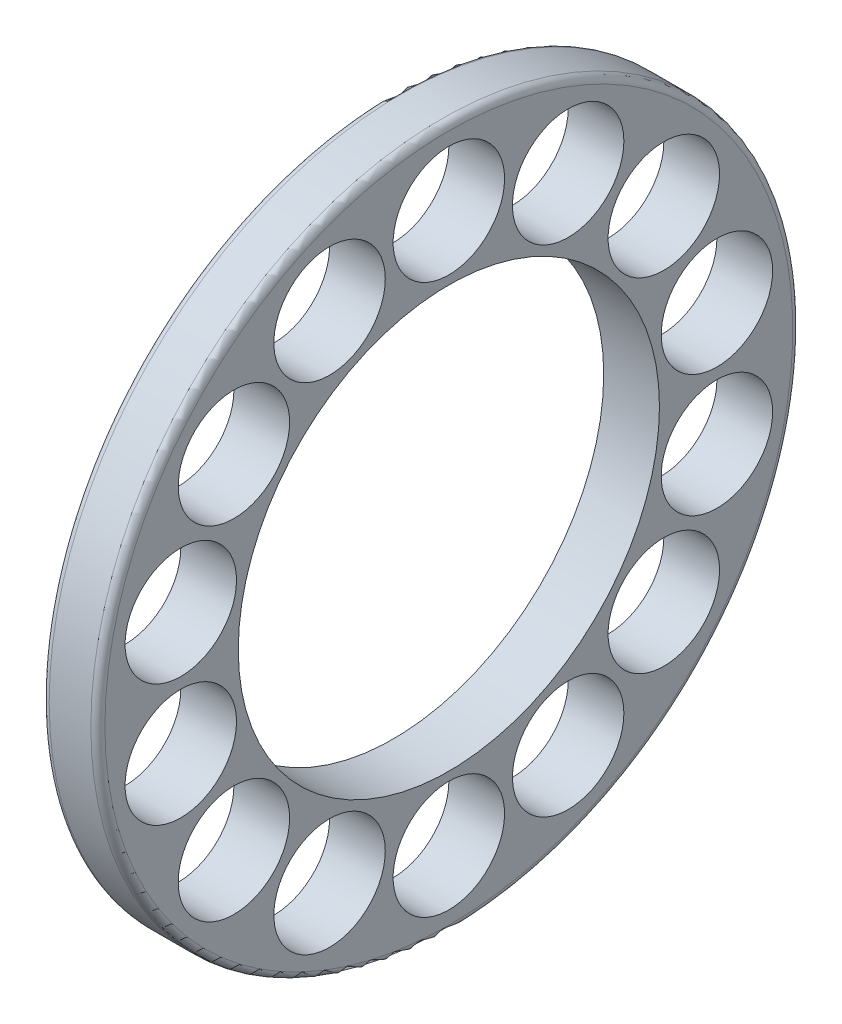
ISO-10303-21;
HEADER;
FILE_DESCRIPTION(('STEP AP214'),'2;1');
FILE_NAME('part.step','',(''),(''),'','','');
FILE_SCHEMA(('AUTOMOTIVE_DESIGN { 1 0 10303 214 1 1 1 1 }'));
ENDSEC;
DATA;
#1=APPLICATION_CONTEXT('core data for automotive mechanical design processes');
#2=APPLICATION_PROTOCOL_DEFINITION('international standard','automotive_design',2000,#1);
#3=PRODUCT_CONTEXT('',#1,'mechanical');
#4=PRODUCT('Part','Part','',(#3));
#5=PRODUCT_RELATED_PRODUCT_CATEGORY('part','',(#4));
#6=PRODUCT_DEFINITION_FORMATION('','',#4);
#7=PRODUCT_DEFINITION_CONTEXT('part definition',#1,'design');
#8=PRODUCT_DEFINITION('design','',#6,#7);
#9=PRODUCT_DEFINITION_SHAPE('','',#8);
#10=(LENGTH_UNIT() NAMED_UNIT(*) SI_UNIT(.MILLI.,.METRE.));
#11=(NAMED_UNIT(*) PLANE_ANGLE_UNIT() SI_UNIT($,.RADIAN.));
#12=(NAMED_UNIT(*) SI_UNIT($,.STERADIAN.) SOLID_ANGLE_UNIT());
#13=UNCERTAINTY_MEASURE_WITH_UNIT(LENGTH_MEASURE(1.E-05),#10,'distance_accuracy_value','');
#14=(GEOMETRIC_REPRESENTATION_CONTEXT(3) GLOBAL_UNCERTAINTY_ASSIGNED_CONTEXT((#13)) GLOBAL_UNIT_ASSIGNED_CONTEXT((#10,
#11,#12)) REPRESENTATION_CONTEXT('',''));
#15=CARTESIAN_POINT('',(0.,0.,0.));
#16=DIRECTION('',(0.,0.,1.));
#17=DIRECTION('',(1.,0.,0.));
#18=AXIS2_PLACEMENT_3D('',#15,#16,#17);
#19=CARTESIAN_POINT('',(3.3095,-14.9730722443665,-14.7));
#20=DIRECTION('',(-1.,0.,0.));
#21=DIRECTION('',(0.,0.,1.));
#22=AXIS2_PLACEMENT_3D('',#19,#20,#21);
#23=PLANE('',#22);
#24=CARTESIAN_POINT('',(3.3095,0.,0.));
#25=DIRECTION('',(-1.,0.,0.));
#26=DIRECTION('',(0.,0.,-1.));
#27=AXIS2_PLACEMENT_3D('',#24,#25,#26);
#28=CIRCLE('',#27,14.7000000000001);
#29=CARTESIAN_POINT('',(3.3095,0.,-14.7000000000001));
#30=VERTEX_POINT('',#29);
#31=EDGE_CURVE('E121',#30,#30,#28,.F.);
#32=ORIENTED_EDGE('',*,*,#31,.F.);
#33=EDGE_LOOP('',(#32));
#34=FACE_BOUND('',#33,.T.);
#35=CARTESIAN_POINT('',(3.3095,0.,0.));
#36=DIRECTION('',(1.,0.,0.));
#37=DIRECTION('',(0.,0.,1.));
#38=AXIS2_PLACEMENT_3D('',#35,#36,#37);
#39=CIRCLE('',#38,9.);
#40=CARTESIAN_POINT('',(3.3095,0.,9.));
#41=VERTEX_POINT('',#40);
#42=EDGE_CURVE('E118',#41,#41,#39,.T.);
#43=ORIENTED_EDGE('',*,*,#42,.T.);
#44=EDGE_LOOP('',(#43));
#45=FACE_BOUND('',#44,.T.);
#46=CARTESIAN_POINT('',(3.3095,-10.586384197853,-5.0981339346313));
#47=DIRECTION('',(1.,0.,0.));
#48=DIRECTION('',(0.,0.,1.));
#49=AXIS2_PLACEMENT_3D('',#46,#47,#48);
#50=CIRCLE('',#49,2.381);
#51=CARTESIAN_POINT('',(3.3095,-10.586384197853,-2.7171339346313));
#52=VERTEX_POINT('',#51);
#53=EDGE_CURVE('E115',#52,#52,#50,.T.);
#54=ORIENTED_EDGE('',*,*,#53,.T.);
#55=EDGE_LOOP('',(#54));
#56=FACE_BOUND('',#55,.T.);
#57=CARTESIAN_POINT('',(3.3095,-7.3260051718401,-9.1865199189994));
#58=DIRECTION('',(1.,0.,0.));
#59=DIRECTION('',(0.,0.,1.));
#60=AXIS2_PLACEMENT_3D('',#57,#58,#59);
#61=CIRCLE('',#60,2.381);
#62=CARTESIAN_POINT('',(3.3095,-7.3260051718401,-6.8055199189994));
#63=VERTEX_POINT('',#62);
#64=EDGE_CURVE('E112',#63,#63,#61,.T.);
#65=ORIENTED_EDGE('',*,*,#64,.T.);
#66=EDGE_LOOP('',(#65));
#67=FACE_BOUND('',#66,.T.);
#68=CARTESIAN_POINT('',(3.3095,-11.75,0.));
#69=DIRECTION('',(1.,0.,0.));
#70=DIRECTION('',(0.,0.,1.));
#71=AXIS2_PLACEMENT_3D('',#68,#69,#70);
#72=CIRCLE('',#71,2.381);
#73=CARTESIAN_POINT('',(3.3095,-11.75,2.381));
#74=VERTEX_POINT('',#73);
#75=EDGE_CURVE('E109',#74,#74,#72,.T.);
#76=ORIENTED_EDGE('',*,*,#75,.T.);
#77=EDGE_LOOP('',(#76));
#78=FACE_BOUND('',#77,.T.);
#79=CARTESIAN_POINT('',(3.3095,-10.586384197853,5.0981339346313));
#80=DIRECTION('',(1.,0.,0.));
#81=DIRECTION('',(0.,0.,1.));
#82=AXIS2_PLACEMENT_3D('',#79,#80,#81);
#83=CIRCLE('',#82,2.381);
#84=CARTESIAN_POINT('',(3.3095,-10.586384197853,7.4791339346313));
#85=VERTEX_POINT('',#84);
#86=EDGE_CURVE('E106',#85,#85,#83,.T.);
#87=ORIENTED_EDGE('',*,*,#86,.T.);
#88=EDGE_LOOP('',(#87));
#89=FACE_BOUND('',#88,.T.);
#90=CARTESIAN_POINT('',(3.3095,-2.6146209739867,11.455402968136));
#91=DIRECTION('',(1.,0.,0.));
#92=DIRECTION('',(0.,0.,1.));
#93=AXIS2_PLACEMENT_3D('',#90,#91,#92);
#94=CIRCLE('',#93,2.381);
#95=CARTESIAN_POINT('',(3.3095,-2.6146209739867,13.836402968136));
#96=VERTEX_POINT('',#95);
#97=EDGE_CURVE('E103',#96,#96,#94,.T.);
#98=ORIENTED_EDGE('',*,*,#97,.T.);
#99=EDGE_LOOP('',(#98));
#100=FACE_BOUND('',#99,.T.);
#101=CARTESIAN_POINT('',(3.3095,-7.3260051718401,9.1865199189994));
#102=DIRECTION('',(1.,0.,0.));
#103=DIRECTION('',(0.,0.,1.));
#104=AXIS2_PLACEMENT_3D('',#101,#102,#103);
#105=CIRCLE('',#104,2.381);
#106=CARTESIAN_POINT('',(3.3095,-7.3260051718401,11.5675199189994));
#107=VERTEX_POINT('',#106);
#108=EDGE_CURVE('E100',#107,#107,#105,.T.);
#109=ORIENTED_EDGE('',*,*,#108,.T.);
#110=EDGE_LOOP('',(#109));
#111=FACE_BOUND('',#110,.T.);
#112=CARTESIAN_POINT('',(3.3095,7.3260051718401,9.1865199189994));
#113=DIRECTION('',(1.,0.,0.));
#114=DIRECTION('',(0.,0.,1.));
#115=AXIS2_PLACEMENT_3D('',#112,#113,#114);
#116=CIRCLE('',#115,2.381);
#117=CARTESIAN_POINT('',(3.3095,7.32600517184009,11.5675199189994));
#118=VERTEX_POINT('',#117);
#119=EDGE_CURVE('E97',#118,#118,#116,.T.);
#120=ORIENTED_EDGE('',*,*,#119,.T.);
#121=EDGE_LOOP('',(#120));
#122=FACE_BOUND('',#121,.T.);
#123=CARTESIAN_POINT('',(3.3095,2.6146209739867,11.455402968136));
#124=DIRECTION('',(1.,0.,0.));
#125=DIRECTION('',(0.,0.,1.));
#126=AXIS2_PLACEMENT_3D('',#123,#124,#125);
#127=CIRCLE('',#126,2.381);
#128=CARTESIAN_POINT('',(3.3095,2.6146209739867,13.836402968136));
#129=VERTEX_POINT('',#128);
#130=EDGE_CURVE('E94',#129,#129,#127,.T.);
#131=ORIENTED_EDGE('',*,*,#130,.T.);
#132=EDGE_LOOP('',(#131));
#133=FACE_BOUND('',#132,.T.);
#134=CARTESIAN_POINT('',(3.3095,7.3260051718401,-9.1865199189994));
#135=DIRECTION('',(1.,0.,0.));
#136=DIRECTION('',(0.,0.,1.));
#137=AXIS2_PLACEMENT_3D('',#134,#135,#136);
#138=CIRCLE('',#137,2.381);
#139=CARTESIAN_POINT('',(3.3095,7.32600517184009,-6.8055199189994));
#140=VERTEX_POINT('',#139);
#141=EDGE_CURVE('E91',#140,#140,#138,.T.);
#142=ORIENTED_EDGE('',*,*,#141,.T.);
#143=EDGE_LOOP('',(#142));
#144=FACE_BOUND('',#143,.T.);
#145=CARTESIAN_POINT('',(3.3095,10.586384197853,-5.0981339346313));
#146=DIRECTION('',(1.,0.,0.));
#147=DIRECTION('',(0.,0.,1.));
#148=AXIS2_PLACEMENT_3D('',#145,#146,#147);
#149=CIRCLE('',#148,2.381);
#150=CARTESIAN_POINT('',(3.3095,10.586384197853,-2.7171339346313));
#151=VERTEX_POINT('',#150);
#152=EDGE_CURVE('E88',#151,#151,#149,.T.);
#153=ORIENTED_EDGE('',*,*,#152,.T.);
#154=EDGE_LOOP('',(#153));
#155=FACE_BOUND('',#154,.T.);
#156=CARTESIAN_POINT('',(3.3095,2.6146209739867,-11.455402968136));
#157=DIRECTION('',(1.,0.,0.));
#158=DIRECTION('',(0.,0.,1.));
#159=AXIS2_PLACEMENT_3D('',#156,#157,#158);
#160=CIRCLE('',#159,2.381);
#161=CARTESIAN_POINT('',(3.3095,2.6146209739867,-9.074402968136));
#162=VERTEX_POINT('',#161);
#163=EDGE_CURVE('E85',#162,#162,#160,.T.);
#164=ORIENTED_EDGE('',*,*,#163,.T.);
#165=EDGE_LOOP('',(#164));
#166=FACE_BOUND('',#165,.T.);
#167=CARTESIAN_POINT('',(3.3095,-2.6146209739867,-11.455402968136));
#168=DIRECTION('',(1.,0.,0.));
#169=DIRECTION('',(0.,0.,1.));
#170=AXIS2_PLACEMENT_3D('',#167,#168,#169);
#171=CIRCLE('',#170,2.381);
#172=CARTESIAN_POINT('',(3.3095,-2.6146209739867,-9.074402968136));
#173=VERTEX_POINT('',#172);
#174=EDGE_CURVE('E82',#173,#173,#171,.T.);
#175=ORIENTED_EDGE('',*,*,#174,.T.);
#176=EDGE_LOOP('',(#175));
#177=FACE_BOUND('',#176,.T.);
#178=CARTESIAN_POINT('',(3.3095,10.586384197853,5.0981339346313));
#179=DIRECTION('',(1.,0.,0.));
#180=DIRECTION('',(0.,0.,1.));
#181=AXIS2_PLACEMENT_3D('',#178,#179,#180);
#182=CIRCLE('',#181,2.381);
#183=CARTESIAN_POINT('',(3.3095,10.586384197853,7.4791339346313));
#184=VERTEX_POINT('',#183);
#185=EDGE_CURVE('E79',#184,#184,#182,.T.);
#186=ORIENTED_EDGE('',*,*,#185,.T.);
#187=EDGE_LOOP('',(#186));
#188=FACE_BOUND('',#187,.T.);
#189=CARTESIAN_POINT('',(3.3095,11.75,0.));
#190=DIRECTION('',(1.,0.,0.));
#191=DIRECTION('',(0.,0.,1.));
#192=AXIS2_PLACEMENT_3D('',#189,#190,#191);
#193=CIRCLE('',#192,2.381);
#194=CARTESIAN_POINT('',(3.3095,11.75,2.381));
#195=VERTEX_POINT('',#194);
#196=EDGE_CURVE('E76',#195,#195,#193,.T.);
#197=ORIENTED_EDGE('',*,*,#196,.T.);
#198=EDGE_LOOP('',(#197));
#199=FACE_BOUND('',#198,.T.);
#200=ADVANCED_FACE('F14',(#34,#45,#56,#67,#78,#89,#100,#111,#122,#133,#144,#155,#166,#177,#188,
#199),#23,.T.);
#201=CARTESIAN_POINT('',(5.6905,-14.9730722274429,14.7));
#202=DIRECTION('',(1.,0.,0.));
#203=DIRECTION('',(0.,0.,-1.));
#204=AXIS2_PLACEMENT_3D('',#201,#202,#203);
#205=PLANE('',#204);
#206=CARTESIAN_POINT('',(5.6905,0.,0.));
#207=DIRECTION('',(1.,0.,0.));
#208=DIRECTION('',(0.,-1.16855749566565E-09,1.));
#209=AXIS2_PLACEMENT_3D('',#206,#207,#208);
#210=CIRCLE('',#209,14.7);
#211=CARTESIAN_POINT('',(5.6905,-1.7177795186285E-08,14.7));
#212=VERTEX_POINT('',#211);
#213=EDGE_CURVE('E73',#212,#212,#210,.T.);
#214=ORIENTED_EDGE('',*,*,#213,.T.);
#215=EDGE_LOOP('',(#214));
#216=FACE_BOUND('',#215,.T.);
#217=CARTESIAN_POINT('',(5.6905,0.,0.));
#218=DIRECTION('',(-1.,0.,0.));
#219=DIRECTION('',(0.,0.,-1.));
#220=AXIS2_PLACEMENT_3D('',#217,#218,#219);
#221=CIRCLE('',#220,9.);
#222=CARTESIAN_POINT('',(5.6905,0.,-9.));
#223=VERTEX_POINT('',#222);
#224=EDGE_CURVE('E70',#223,#223,#221,.F.);
#225=ORIENTED_EDGE('',*,*,#224,.F.);
#226=EDGE_LOOP('',(#225));
#227=FACE_BOUND('',#226,.T.);
#228=CARTESIAN_POINT('',(5.6905,-10.586384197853,-5.0981339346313));
#229=DIRECTION('',(-1.,0.,0.));
#230=DIRECTION('',(0.,0.,-1.));
#231=AXIS2_PLACEMENT_3D('',#228,#229,#230);
#232=CIRCLE('',#231,2.381);
#233=CARTESIAN_POINT('',(5.6905,-10.586384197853,-7.4791339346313));
#234=VERTEX_POINT('',#233);
#235=EDGE_CURVE('E67',#234,#234,#232,.T.);
#236=ORIENTED_EDGE('',*,*,#235,.T.);
#237=EDGE_LOOP('',(#236));
#238=FACE_BOUND('',#237,.T.);
#239=CARTESIAN_POINT('',(5.6905,-7.3260051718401,-9.1865199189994));
#240=DIRECTION('',(-1.,0.,0.));
#241=DIRECTION('',(0.,0.,-1.));
#242=AXIS2_PLACEMENT_3D('',#239,#240,#241);
#243=CIRCLE('',#242,2.381);
#244=CARTESIAN_POINT('',(5.6905,-7.3260051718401,-11.5675199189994));
#245=VERTEX_POINT('',#244);
#246=EDGE_CURVE('E64',#245,#245,#243,.T.);
#247=ORIENTED_EDGE('',*,*,#246,.T.);
#248=EDGE_LOOP('',(#247));
#249=FACE_BOUND('',#248,.T.);
#250=CARTESIAN_POINT('',(5.6905,-11.75,0.));
#251=DIRECTION('',(-1.,0.,0.));
#252=DIRECTION('',(0.,0.,-1.));
#253=AXIS2_PLACEMENT_3D('',#250,#251,#252);
#254=CIRCLE('',#253,2.381);
#255=CARTESIAN_POINT('',(5.6905,-11.75,-2.381));
#256=VERTEX_POINT('',#255);
#257=EDGE_CURVE('E61',#256,#256,#254,.T.);
#258=ORIENTED_EDGE('',*,*,#257,.T.);
#259=EDGE_LOOP('',(#258));
#260=FACE_BOUND('',#259,.T.);
#261=CARTESIAN_POINT('',(5.6905,-10.586384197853,5.0981339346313));
#262=DIRECTION('',(-1.,0.,0.));
#263=DIRECTION('',(0.,0.,-1.));
#264=AXIS2_PLACEMENT_3D('',#261,#262,#263);
#265=CIRCLE('',#264,2.381);
#266=CARTESIAN_POINT('',(5.6905,-10.586384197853,2.7171339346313));
#267=VERTEX_POINT('',#266);
#268=EDGE_CURVE('E58',#267,#267,#265,.T.);
#269=ORIENTED_EDGE('',*,*,#268,.T.);
#270=EDGE_LOOP('',(#269));
#271=FACE_BOUND('',#270,.T.);
#272=CARTESIAN_POINT('',(5.6905,-2.6146209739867,11.455402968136));
#273=DIRECTION('',(-1.,0.,0.));
#274=DIRECTION('',(0.,0.,-1.));
#275=AXIS2_PLACEMENT_3D('',#272,#273,#274);
#276=CIRCLE('',#275,2.381);
#277=CARTESIAN_POINT('',(5.6905,-2.6146209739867,9.074402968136));
#278=VERTEX_POINT('',#277);
#279=EDGE_CURVE('E55',#278,#278,#276,.T.);
#280=ORIENTED_EDGE('',*,*,#279,.T.);
#281=EDGE_LOOP('',(#280));
#282=FACE_BOUND('',#281,.T.);
#283=CARTESIAN_POINT('',(5.6905,-7.3260051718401,9.1865199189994));
#284=DIRECTION('',(-1.,0.,0.));
#285=DIRECTION('',(0.,0.,-1.));
#286=AXIS2_PLACEMENT_3D('',#283,#284,#285);
#287=CIRCLE('',#286,2.381);
#288=CARTESIAN_POINT('',(5.6905,-7.3260051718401,6.8055199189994));
#289=VERTEX_POINT('',#288);
#290=EDGE_CURVE('E52',#289,#289,#287,.T.);
#291=ORIENTED_EDGE('',*,*,#290,.T.);
#292=EDGE_LOOP('',(#291));
#293=FACE_BOUND('',#292,.T.);
#294=CARTESIAN_POINT('',(5.6905,7.3260051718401,9.1865199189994));
#295=DIRECTION('',(-1.,0.,0.));
#296=DIRECTION('',(0.,0.,-1.));
#297=AXIS2_PLACEMENT_3D('',#294,#295,#296);
#298=CIRCLE('',#297,2.381);
#299=CARTESIAN_POINT('',(5.6905,7.3260051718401,6.8055199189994));
#300=VERTEX_POINT('',#299);
#301=EDGE_CURVE('E49',#300,#300,#298,.T.);
#302=ORIENTED_EDGE('',*,*,#301,.T.);
#303=EDGE_LOOP('',(#302));
#304=FACE_BOUND('',#303,.T.);
#305=CARTESIAN_POINT('',(5.6905,2.6146209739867,11.455402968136));
#306=DIRECTION('',(-1.,0.,0.));
#307=DIRECTION('',(0.,0.,-1.));
#308=AXIS2_PLACEMENT_3D('',#305,#306,#307);
#309=CIRCLE('',#308,2.381);
#310=CARTESIAN_POINT('',(5.6905,2.6146209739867,9.074402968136));
#311=VERTEX_POINT('',#310);
#312=EDGE_CURVE('E46',#311,#311,#309,.T.);
#313=ORIENTED_EDGE('',*,*,#312,.T.);
#314=EDGE_LOOP('',(#313));
#315=FACE_BOUND('',#314,.T.);
#316=CARTESIAN_POINT('',(5.6905,7.3260051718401,-9.1865199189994));
#317=DIRECTION('',(-1.,0.,0.));
#318=DIRECTION('',(0.,0.,-1.));
#319=AXIS2_PLACEMENT_3D('',#316,#317,#318);
#320=CIRCLE('',#319,2.381);
#321=CARTESIAN_POINT('',(5.6905,7.3260051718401,-11.5675199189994));
#322=VERTEX_POINT('',#321);
#323=EDGE_CURVE('E43',#322,#322,#320,.T.);
#324=ORIENTED_EDGE('',*,*,#323,.T.);
#325=EDGE_LOOP('',(#324));
#326=FACE_BOUND('',#325,.T.);
#327=CARTESIAN_POINT('',(5.6905,10.586384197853,-5.0981339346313));
#328=DIRECTION('',(-1.,0.,0.));
#329=DIRECTION('',(0.,-1.42053886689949E-07,-0.99999999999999));
#330=AXIS2_PLACEMENT_3D('',#327,#328,#329);
#331=CIRCLE('',#330,2.381);
#332=CARTESIAN_POINT('',(5.6905,10.5863838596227,-7.47913393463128));
#333=VERTEX_POINT('',#332);
#334=EDGE_CURVE('E40',#333,#333,#331,.T.);
#335=ORIENTED_EDGE('',*,*,#334,.T.);
#336=EDGE_LOOP('',(#335));
#337=FACE_BOUND('',#336,.T.);
#338=CARTESIAN_POINT('',(5.6905,2.6146209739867,-11.455402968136));
#339=DIRECTION('',(-1.,0.,0.));
#340=DIRECTION('',(0.,0.,-1.));
#341=AXIS2_PLACEMENT_3D('',#338,#339,#340);
#342=CIRCLE('',#341,2.381);
#343=CARTESIAN_POINT('',(5.6905,2.6146209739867,-13.836402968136));
#344=VERTEX_POINT('',#343);
#345=EDGE_CURVE('E37',#344,#344,#342,.T.);
#346=ORIENTED_EDGE('',*,*,#345,.T.);
#347=EDGE_LOOP('',(#346));
#348=FACE_BOUND('',#347,.T.);
#349=CARTESIAN_POINT('',(5.6905,-2.6146209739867,-11.455402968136));
#350=DIRECTION('',(-1.,0.,0.));
#351=DIRECTION('',(0.,0.,-1.));
#352=AXIS2_PLACEMENT_3D('',#349,#350,#351);
#353=CIRCLE('',#352,2.381);
#354=CARTESIAN_POINT('',(5.6905,-2.6146209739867,-13.836402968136));
#355=VERTEX_POINT('',#354);
#356=EDGE_CURVE('E34',#355,#355,#353,.T.);
#357=ORIENTED_EDGE('',*,*,#356,.T.);
#358=EDGE_LOOP('',(#357));
#359=FACE_BOUND('',#358,.T.);
#360=CARTESIAN_POINT('',(5.6905,10.586384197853,5.0981339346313));
#361=DIRECTION('',(-1.,0.,0.));
#362=DIRECTION('',(0.,-1.42053903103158E-07,-0.99999999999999));
#363=AXIS2_PLACEMENT_3D('',#360,#361,#362);
#364=CIRCLE('',#363,2.381);
#365=CARTESIAN_POINT('',(5.6905,10.5863838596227,2.71713393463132));
#366=VERTEX_POINT('',#365);
#367=EDGE_CURVE('E29',#366,#366,#364,.T.);
#368=ORIENTED_EDGE('',*,*,#367,.T.);
#369=EDGE_LOOP('',(#368));
#370=FACE_BOUND('',#369,.T.);
#371=CARTESIAN_POINT('',(5.6905,11.75,0.));
#372=DIRECTION('',(-1.,0.,0.));
#373=DIRECTION('',(0.,-1.42053906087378E-07,-0.99999999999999));
#374=AXIS2_PLACEMENT_3D('',#371,#372,#373);
#375=CIRCLE('',#374,2.381);
#376=CARTESIAN_POINT('',(5.6905,11.7499996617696,-2.38099999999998));
#377=VERTEX_POINT('',#376);
#378=EDGE_CURVE('E25',#377,#377,#375,.T.);
#379=ORIENTED_EDGE('',*,*,#378,.T.);
#380=EDGE_LOOP('',(#379));
#381=FACE_BOUND('',#380,.T.);
#382=ADVANCED_FACE('F130',(#216,#227,#238,#249,#260,#271,#282,#293,#304,#315,#326,#337,#348,
#359,#370,#381),#205,.T.);
#383=CARTESIAN_POINT('',(3.60949999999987,0.,0.));
#384=DIRECTION('',(1.,0.,0.));
#385=DIRECTION('',(0.,1.16855826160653E-09,1.));
#386=AXIS2_PLACEMENT_3D('',#383,#384,#385);
#387=TOROIDAL_SURFACE('',#386,14.7000000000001,0.299999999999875);
#388=ORIENTED_EDGE('',*,*,#31,.T.);
#389=EDGE_LOOP('',(#388));
#390=FACE_BOUND('',#389,.T.);
#391=CARTESIAN_POINT('',(3.60949999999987,0.,0.));
#392=DIRECTION('',(-1.,0.,0.));
#393=DIRECTION('',(0.,0.,-1.));
#394=AXIS2_PLACEMENT_3D('',#391,#392,#393);
#395=CIRCLE('',#394,15.);
#396=CARTESIAN_POINT('',(3.60949999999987,0.,-15.));
#397=VERTEX_POINT('',#396);
#398=EDGE_CURVE('E21',#397,#397,#395,.F.);
#399=ORIENTED_EDGE('',*,*,#398,.F.);
#400=EDGE_LOOP('',(#399));
#401=FACE_BOUND('',#400,.T.);
#402=ADVANCED_FACE('F125',(#390,#401),#387,.T.);
#403=CARTESIAN_POINT('',(5.6905,0.,0.));
#404=DIRECTION('',(1.,0.,0.));
#405=DIRECTION('',(0.,0.,1.));
#406=AXIS2_PLACEMENT_3D('',#403,#404,#405);
#407=CYLINDRICAL_SURFACE('',#406,9.);
#408=ORIENTED_EDGE('',*,*,#224,.T.);
#409=EDGE_LOOP('',(#408));
#410=FACE_BOUND('',#409,.T.);
#411=ORIENTED_EDGE('',*,*,#42,.F.);
#412=EDGE_LOOP('',(#411));
#413=FACE_BOUND('',#412,.T.);
#414=ADVANCED_FACE('F177',(#410,#413),#407,.F.);
#415=CARTESIAN_POINT('',(5.39050000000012,0.,0.));
#416=DIRECTION('',(1.,0.,0.));
#417=DIRECTION('',(0.,0.,1.));
#418=AXIS2_PLACEMENT_3D('',#415,#416,#417);
#419=TOROIDAL_SURFACE('',#418,14.7000000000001,0.299999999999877);
#420=CARTESIAN_POINT('',(5.39050000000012,0.,0.));
#421=DIRECTION('',(1.,0.,0.));
#422=DIRECTION('',(0.,0.,1.));
#423=AXIS2_PLACEMENT_3D('',#420,#421,#422);
#424=CIRCLE('',#423,15.);
#425=CARTESIAN_POINT('',(5.39050000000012,0.,15.));
#426=VERTEX_POINT('',#425);
#427=EDGE_CURVE('E9',#426,#426,#424,.T.);
#428=ORIENTED_EDGE('',*,*,#427,.T.);
#429=EDGE_LOOP('',(#428));
#430=FACE_BOUND('',#429,.T.);
#431=ORIENTED_EDGE('',*,*,#213,.F.);
#432=EDGE_LOOP('',(#431));
#433=FACE_BOUND('',#432,.T.);
#434=ADVANCED_FACE('F183',(#430,#433),#419,.T.);
#435=CARTESIAN_POINT('',(5.6905,0.,0.));
#436=DIRECTION('',(1.,0.,0.));
#437=DIRECTION('',(0.,1.92343152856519E-10,1.));
#438=AXIS2_PLACEMENT_3D('',#435,#436,#437);
#439=CYLINDRICAL_SURFACE('',#438,15.);
#440=ORIENTED_EDGE('',*,*,#398,.T.);
#441=EDGE_LOOP('',(#440));
#442=FACE_BOUND('',#441,.T.);
#443=ORIENTED_EDGE('',*,*,#427,.F.);
#444=EDGE_LOOP('',(#443));
#445=FACE_BOUND('',#444,.T.);
#446=ADVANCED_FACE('F166',(#442,#445),#439,.T.);
#447=CARTESIAN_POINT('',(9.,11.75,0.));
#448=DIRECTION('',(-1.,0.,0.));
#449=DIRECTION('',(0.,0.,-1.));
#450=AXIS2_PLACEMENT_3D('',#447,#448,#449);
#451=CYLINDRICAL_SURFACE('',#450,2.381);
#452=ORIENTED_EDGE('',*,*,#196,.F.);
#453=EDGE_LOOP('',(#452));
#454=FACE_BOUND('',#453,.T.);
#455=ORIENTED_EDGE('',*,*,#378,.F.);
#456=EDGE_LOOP('',(#455));
#457=FACE_BOUND('',#456,.T.);
#458=ADVANCED_FACE('F162',(#454,#457),#451,.F.);
#459=CARTESIAN_POINT('',(9.,10.586384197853,5.0981339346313));
#460=DIRECTION('',(-1.,0.,0.));
#461=DIRECTION('',(0.,0.,-1.));
#462=AXIS2_PLACEMENT_3D('',#459,#460,#461);
#463=CYLINDRICAL_SURFACE('',#462,2.381);
#464=ORIENTED_EDGE('',*,*,#185,.F.);
#465=EDGE_LOOP('',(#464));
#466=FACE_BOUND('',#465,.T.);
#467=ORIENTED_EDGE('',*,*,#367,.F.);
#468=EDGE_LOOP('',(#467));
#469=FACE_BOUND('',#468,.T.);
#470=ADVANCED_FACE('F165',(#466,#469),#463,.F.);
#471=CARTESIAN_POINT('',(9.,-2.6146209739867,-11.455402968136));
#472=DIRECTION('',(-1.,0.,0.));
#473=DIRECTION('',(0.,1.42053885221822E-07,-0.99999999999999));
#474=AXIS2_PLACEMENT_3D('',#471,#472,#473);
#475=CYLINDRICAL_SURFACE('',#474,2.381);
#476=ORIENTED_EDGE('',*,*,#174,.F.);
#477=EDGE_LOOP('',(#476));
#478=FACE_BOUND('',#477,.T.);
#479=ORIENTED_EDGE('',*,*,#356,.F.);
#480=EDGE_LOOP('',(#479));
#481=FACE_BOUND('',#480,.T.);
#482=ADVANCED_FACE('F191',(#478,#481),#475,.F.);
#483=CARTESIAN_POINT('',(9.,2.6146209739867,-11.455402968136));
#484=DIRECTION('',(-1.,0.,0.));
#485=DIRECTION('',(0.,0.,-1.));
#486=AXIS2_PLACEMENT_3D('',#483,#484,#485);
#487=CYLINDRICAL_SURFACE('',#486,2.381);
#488=ORIENTED_EDGE('',*,*,#163,.F.);
#489=EDGE_LOOP('',(#488));
#490=FACE_BOUND('',#489,.T.);
#491=ORIENTED_EDGE('',*,*,#345,.F.);
#492=EDGE_LOOP('',(#491));
#493=FACE_BOUND('',#492,.T.);
#494=ADVANCED_FACE('F195',(#490,#493),#487,.F.);
#495=CARTESIAN_POINT('',(9.,10.586384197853,-5.0981339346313));
#496=DIRECTION('',(-1.,0.,0.));
#497=DIRECTION('',(0.,0.,-1.));
#498=AXIS2_PLACEMENT_3D('',#495,#496,#497);
#499=CYLINDRICAL_SURFACE('',#498,2.381);
#500=ORIENTED_EDGE('',*,*,#152,.F.);
#501=EDGE_LOOP('',(#500));
#502=FACE_BOUND('',#501,.T.);
#503=ORIENTED_EDGE('',*,*,#334,.F.);
#504=EDGE_LOOP('',(#503));
#505=FACE_BOUND('',#504,.T.);
#506=ADVANCED_FACE('F199',(#502,#505),#499,.F.);
#507=CARTESIAN_POINT('',(9.,7.3260051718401,-9.1865199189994));
#508=DIRECTION('',(-1.,0.,0.));
#509=DIRECTION('',(0.,0.,-1.));
#510=AXIS2_PLACEMENT_3D('',#507,#508,#509);
#511=CYLINDRICAL_SURFACE('',#510,2.381);
#512=ORIENTED_EDGE('',*,*,#141,.F.);
#513=EDGE_LOOP('',(#512));
#514=FACE_BOUND('',#513,.T.);
#515=ORIENTED_EDGE('',*,*,#323,.F.);
#516=EDGE_LOOP('',(#515));
#517=FACE_BOUND('',#516,.T.);
#518=ADVANCED_FACE('F203',(#514,#517),#511,.F.);
#519=CARTESIAN_POINT('',(9.,2.6146209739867,11.455402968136));
#520=DIRECTION('',(-1.,0.,0.));
#521=DIRECTION('',(0.,0.,-1.));
#522=AXIS2_PLACEMENT_3D('',#519,#520,#521);
#523=CYLINDRICAL_SURFACE('',#522,2.381);
#524=ORIENTED_EDGE('',*,*,#130,.F.);
#525=EDGE_LOOP('',(#524));
#526=FACE_BOUND('',#525,.T.);
#527=ORIENTED_EDGE('',*,*,#312,.F.);
#528=EDGE_LOOP('',(#527));
#529=FACE_BOUND('',#528,.T.);
#530=ADVANCED_FACE('F207',(#526,#529),#523,.F.);
#531=CARTESIAN_POINT('',(9.,7.3260051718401,9.1865199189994));
#532=DIRECTION('',(-1.,0.,0.));
#533=DIRECTION('',(0.,0.,-1.));
#534=AXIS2_PLACEMENT_3D('',#531,#532,#533);
#535=CYLINDRICAL_SURFACE('',#534,2.381);
#536=ORIENTED_EDGE('',*,*,#119,.F.);
#537=EDGE_LOOP('',(#536));
#538=FACE_BOUND('',#537,.T.);
#539=ORIENTED_EDGE('',*,*,#301,.F.);
#540=EDGE_LOOP('',(#539));
#541=FACE_BOUND('',#540,.T.);
#542=ADVANCED_FACE('F211',(#538,#541),#535,.F.);
#543=CARTESIAN_POINT('',(9.,-7.3260051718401,9.1865199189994));
#544=DIRECTION('',(-1.,0.,0.));
#545=DIRECTION('',(0.,1.42053843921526E-07,-0.99999999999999));
#546=AXIS2_PLACEMENT_3D('',#543,#544,#545);
#547=CYLINDRICAL_SURFACE('',#546,2.381);
#548=ORIENTED_EDGE('',*,*,#108,.F.);
#549=EDGE_LOOP('',(#548));
#550=FACE_BOUND('',#549,.T.);
#551=ORIENTED_EDGE('',*,*,#290,.F.);
#552=EDGE_LOOP('',(#551));
#553=FACE_BOUND('',#552,.T.);
#554=ADVANCED_FACE('F215',(#550,#553),#547,.F.);
#555=CARTESIAN_POINT('',(9.,-2.6146209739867,11.455402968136));
#556=DIRECTION('',(-1.,0.,0.));
#557=DIRECTION('',(0.,1.42053885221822E-07,-0.99999999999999));
#558=AXIS2_PLACEMENT_3D('',#555,#556,#557);
#559=CYLINDRICAL_SURFACE('',#558,2.381);
#560=ORIENTED_EDGE('',*,*,#97,.F.);
#561=EDGE_LOOP('',(#560));
#562=FACE_BOUND('',#561,.T.);
#563=ORIENTED_EDGE('',*,*,#279,.F.);
#564=EDGE_LOOP('',(#563));
#565=FACE_BOUND('',#564,.T.);
#566=ADVANCED_FACE('F219',(#562,#565),#559,.F.);
#567=CARTESIAN_POINT('',(9.,-10.586384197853,5.0981339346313));
#568=DIRECTION('',(-1.,0.,0.));
#569=DIRECTION('',(0.,1.42053904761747E-07,-0.99999999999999));
#570=AXIS2_PLACEMENT_3D('',#567,#568,#569);
#571=CYLINDRICAL_SURFACE('',#570,2.381);
#572=ORIENTED_EDGE('',*,*,#86,.F.);
#573=EDGE_LOOP('',(#572));
#574=FACE_BOUND('',#573,.T.);
#575=ORIENTED_EDGE('',*,*,#268,.F.);
#576=EDGE_LOOP('',(#575));
#577=FACE_BOUND('',#576,.T.);
#578=ADVANCED_FACE('F223',(#574,#577),#571,.F.);
#579=CARTESIAN_POINT('',(9.,-11.75,0.));
#580=DIRECTION('',(-1.,0.,0.));
#581=DIRECTION('',(0.,1.42053905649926E-07,-0.99999999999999));
#582=AXIS2_PLACEMENT_3D('',#579,#580,#581);
#583=CYLINDRICAL_SURFACE('',#582,2.381);
#584=ORIENTED_EDGE('',*,*,#75,.F.);
#585=EDGE_LOOP('',(#584));
#586=FACE_BOUND('',#585,.T.);
#587=ORIENTED_EDGE('',*,*,#257,.F.);
#588=EDGE_LOOP('',(#587));
#589=FACE_BOUND('',#588,.T.);
#590=ADVANCED_FACE('F227',(#586,#589),#583,.F.);
#591=CARTESIAN_POINT('',(9.,-7.3260051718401,-9.1865199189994));
#592=DIRECTION('',(-1.,0.,0.));
#593=DIRECTION('',(0.,1.42053884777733E-07,-0.99999999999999));
#594=AXIS2_PLACEMENT_3D('',#591,#592,#593);
#595=CYLINDRICAL_SURFACE('',#594,2.381);
#596=ORIENTED_EDGE('',*,*,#64,.F.);
#597=EDGE_LOOP('',(#596));
#598=FACE_BOUND('',#597,.T.);
#599=ORIENTED_EDGE('',*,*,#246,.F.);
#600=EDGE_LOOP('',(#599));
#601=FACE_BOUND('',#600,.T.);
#602=ADVANCED_FACE('F230',(#598,#601),#595,.F.);
#603=CARTESIAN_POINT('',(9.,-10.586384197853,-5.0981339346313));
#604=DIRECTION('',(-1.,0.,0.));
#605=DIRECTION('',(0.,1.42053884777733E-07,-0.99999999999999));
#606=AXIS2_PLACEMENT_3D('',#603,#604,#605);
#607=CYLINDRICAL_SURFACE('',#606,2.381);
#608=ORIENTED_EDGE('',*,*,#53,.F.);
#609=EDGE_LOOP('',(#608));
#610=FACE_BOUND('',#609,.T.);
#611=ORIENTED_EDGE('',*,*,#235,.F.);
#612=EDGE_LOOP('',(#611));
#613=FACE_BOUND('',#612,.T.);
#614=ADVANCED_FACE('F16',(#610,#613),#607,.F.);
#615=CLOSED_SHELL('',(#200,#382,#402,#414,#434,#446,#458,#470,#482,#494,#506,#518,#530,#542,
#554,#566,#578,#590,#602,#614));
#616=MANIFOLD_SOLID_BREP('B1',#615);
#617=ADVANCED_BREP_SHAPE_REPRESENTATION('',(#18,#616),#14);
#618=SHAPE_DEFINITION_REPRESENTATION(#9,#617);
ENDSEC;
END-ISO-10303-21;
